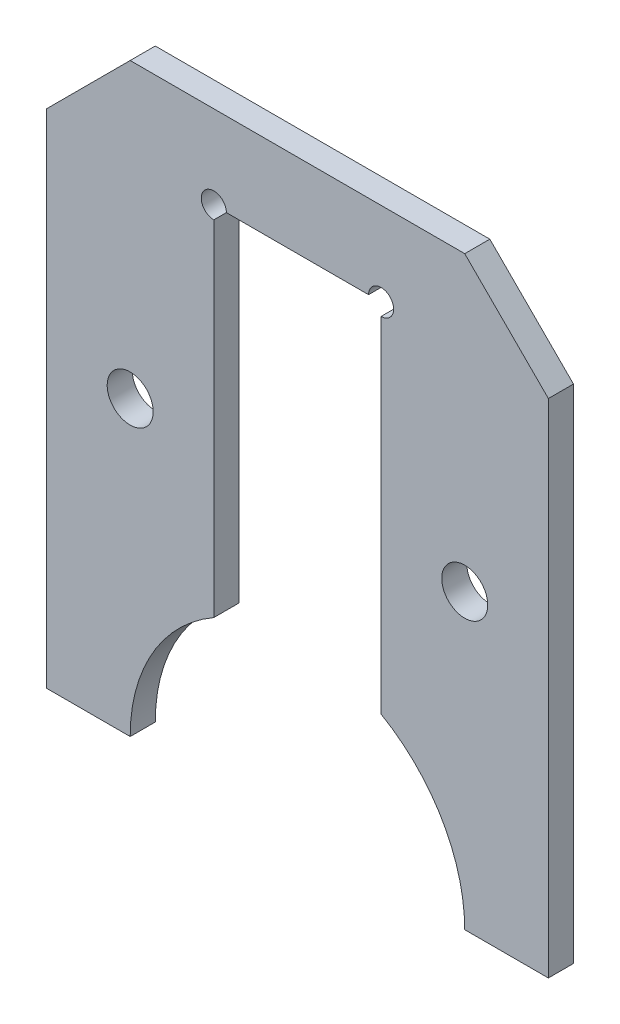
from build123d import *

# Parameters (mm, degrees)
SKETCH1_R      = 2.75
EXTRUDE1_DEPTH = 3


with BuildPart() as part:
    # Sketch1 → Extrude1 (new body)
    with BuildSketch(Plane.XY):
        with BuildLine():
            Line((-20, 70), (20, 70))
            Line((20, 70), (30, 60))
            Line((30, 60), (30, 0))
            Line((30, 0), (20, 0))
            ThreePointArc((20, 0), (17.320508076, 10), (10, 17.320508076))
            Line((10, 17.320508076), (10, 58.5))
            ThreePointArc((10, 58.5), (11.060660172, 61.060660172), (8.5, 60))
            Line((8.5, 60), (-8.5, 60))
            ThreePointArc((-8.5, 60), (-11.060660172, 61.060660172), (-10, 58.5))
            Line((-10, 58.5), (-10, 17.320508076))
            ThreePointArc((-10, 17.320508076), (-17.320508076, 10), (-20, 0))
            Line((-20, 0), (-30, 0))
            Line((-30, 0), (-30, 60))
            Line((-30, 60), (-20, 70))
        make_face()
        with Locations((20, 35)):
            Circle(SKETCH1_R, mode=Mode.SUBTRACT)
        with Locations(Location((-20, 35, 0), (0, 0, 180))):
            Circle(SKETCH1_R, mode=Mode.SUBTRACT)
    extrude(amount=EXTRUDE1_DEPTH)


solid = part.part
